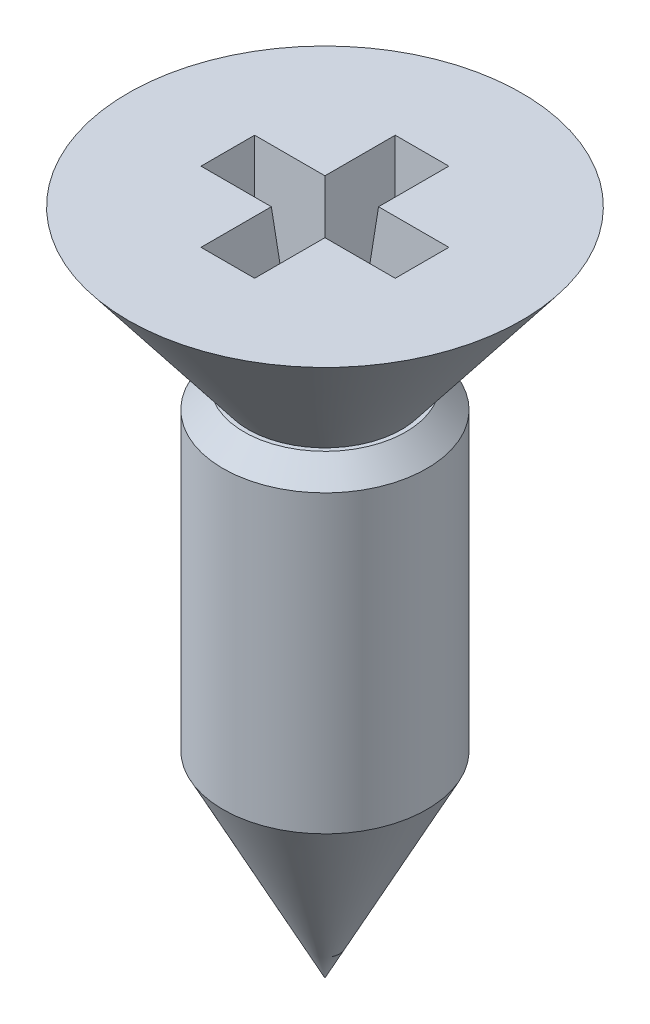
ISO-10303-21;
HEADER;
FILE_DESCRIPTION(('STEP AP214'),'2;1');
FILE_NAME('part.step','',(''),(''),'','','');
FILE_SCHEMA(('AUTOMOTIVE_DESIGN { 1 0 10303 214 1 1 1 1 }'));
ENDSEC;
DATA;
#1=APPLICATION_CONTEXT('core data for automotive mechanical design processes');
#2=APPLICATION_PROTOCOL_DEFINITION('international standard','automotive_design',2000,#1);
#3=PRODUCT_CONTEXT('',#1,'mechanical');
#4=PRODUCT('Part','Part','',(#3));
#5=PRODUCT_RELATED_PRODUCT_CATEGORY('part','',(#4));
#6=PRODUCT_DEFINITION_FORMATION('','',#4);
#7=PRODUCT_DEFINITION_CONTEXT('part definition',#1,'design');
#8=PRODUCT_DEFINITION('design','',#6,#7);
#9=PRODUCT_DEFINITION_SHAPE('','',#8);
#10=(LENGTH_UNIT() NAMED_UNIT(*) SI_UNIT(.MILLI.,.METRE.));
#11=(NAMED_UNIT(*) PLANE_ANGLE_UNIT() SI_UNIT($,.RADIAN.));
#12=(NAMED_UNIT(*) SI_UNIT($,.STERADIAN.) SOLID_ANGLE_UNIT());
#13=UNCERTAINTY_MEASURE_WITH_UNIT(LENGTH_MEASURE(1.E-05),#10,'distance_accuracy_value','');
#14=(GEOMETRIC_REPRESENTATION_CONTEXT(3) GLOBAL_UNCERTAINTY_ASSIGNED_CONTEXT((#13)) GLOBAL_UNIT_ASSIGNED_CONTEXT((#10,
#11,#12)) REPRESENTATION_CONTEXT('',''));
#15=CARTESIAN_POINT('',(0.,0.,0.));
#16=DIRECTION('',(0.,0.,1.));
#17=DIRECTION('',(1.,0.,0.));
#18=AXIS2_PLACEMENT_3D('',#15,#16,#17);
#19=CARTESIAN_POINT('',(0.,-12.9482396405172,0.));
#20=DIRECTION('',(0.,1.,0.));
#21=DIRECTION('',(0.,0.,1.));
#22=AXIS2_PLACEMENT_3D('',#19,#20,#21);
#23=CONICAL_SURFACE('',#22,0.,0.477831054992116);
#24=CARTESIAN_POINT('',(0.,-10.1482396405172,0.));
#25=DIRECTION('',(0.,1.,0.));
#26=DIRECTION('',(0.,0.,1.));
#27=AXIS2_PLACEMENT_3D('',#24,#25,#26);
#28=CIRCLE('',#27,1.45);
#29=CARTESIAN_POINT('',(0.,-10.1482396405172,1.45));
#30=VERTEX_POINT('',#29);
#31=EDGE_CURVE('E192',#30,#30,#28,.T.);
#32=ORIENTED_EDGE('',*,*,#31,.F.);
#33=EDGE_LOOP('',(#32));
#34=FACE_BOUND('',#33,.T.);
#35=CARTESIAN_POINT('',(0.,-12.9482396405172,0.));
#36=VERTEX_POINT('',#35);
#37=VERTEX_LOOP('',#36);
#38=FACE_BOUND('',#37,.T.);
#39=ADVANCED_FACE('F26',(#34,#38),#23,.T.);
#40=CARTESIAN_POINT('',(0.,0.,0.));
#41=DIRECTION('',(0.,1.,0.));
#42=DIRECTION('',(0.,0.,1.));
#43=AXIS2_PLACEMENT_3D('',#40,#41,#42);
#44=CYLINDRICAL_SURFACE('',#43,1.45);
#45=CARTESIAN_POINT('',(0.,-5.94823964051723,0.));
#46=DIRECTION('',(0.,-1.,0.));
#47=DIRECTION('',(0.,0.,-1.));
#48=AXIS2_PLACEMENT_3D('',#45,#46,#47);
#49=CIRCLE('',#48,1.45);
#50=CARTESIAN_POINT('',(0.,-5.94823964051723,-1.45));
#51=VERTEX_POINT('',#50);
#52=EDGE_CURVE('E11',#51,#51,#49,.T.);
#53=ORIENTED_EDGE('',*,*,#52,.T.);
#54=EDGE_LOOP('',(#53));
#55=FACE_BOUND('',#54,.T.);
#56=ORIENTED_EDGE('',*,*,#31,.T.);
#57=EDGE_LOOP('',(#56));
#58=FACE_BOUND('',#57,.T.);
#59=ADVANCED_FACE('F276',(#55,#58),#44,.T.);
#60=CARTESIAN_POINT('',(1.09,-5.64823964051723,0.));
#61=DIRECTION('',(0.,-1.,0.));
#62=DIRECTION('',(0.,0.,-1.));
#63=AXIS2_PLACEMENT_3D('',#60,#61,#62);
#64=PLANE('',#63);
#65=CARTESIAN_POINT('',(0.,-5.64823964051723,0.));
#66=DIRECTION('',(0.,-1.,0.));
#67=DIRECTION('',(0.,0.,-1.));
#68=AXIS2_PLACEMENT_3D('',#65,#66,#67);
#69=CIRCLE('',#68,1.15000000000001);
#70=CARTESIAN_POINT('',(0.,-5.64823964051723,-1.15));
#71=VERTEX_POINT('',#70);
#72=EDGE_CURVE('E36',#71,#71,#69,.F.);
#73=ORIENTED_EDGE('',*,*,#72,.T.);
#74=EDGE_LOOP('',(#73));
#75=FACE_BOUND('',#74,.T.);
#76=CARTESIAN_POINT('',(0.,-5.64823964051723,0.));
#77=DIRECTION('',(0.,1.,0.));
#78=DIRECTION('',(0.,0.,1.));
#79=AXIS2_PLACEMENT_3D('',#76,#77,#78);
#80=CIRCLE('',#79,1.09);
#81=CARTESIAN_POINT('',(0.,-5.64823964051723,1.09));
#82=VERTEX_POINT('',#81);
#83=EDGE_CURVE('E195',#82,#82,#80,.T.);
#84=ORIENTED_EDGE('',*,*,#83,.F.);
#85=EDGE_LOOP('',(#84));
#86=FACE_BOUND('',#85,.T.);
#87=ADVANCED_FACE('F283',(#75,#86),#64,.F.);
#88=CARTESIAN_POINT('',(0.,-5.64823964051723,0.));
#89=DIRECTION('',(0.,1.,0.));
#90=DIRECTION('',(0.,0.,1.));
#91=AXIS2_PLACEMENT_3D('',#88,#89,#90);
#92=CONICAL_SURFACE('',#91,1.09,0.66072840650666);
#93=CARTESIAN_POINT('',(0.,-3.44823964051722,0.));
#94=DIRECTION('',(0.,1.,0.));
#95=DIRECTION('',(0.,0.,1.));
#96=AXIS2_PLACEMENT_3D('',#93,#94,#95);
#97=CIRCLE('',#96,2.8);
#98=CARTESIAN_POINT('',(0.,-3.44823964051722,2.8));
#99=VERTEX_POINT('',#98);
#100=EDGE_CURVE('E182',#99,#99,#97,.T.);
#101=ORIENTED_EDGE('',*,*,#100,.F.);
#102=EDGE_LOOP('',(#101));
#103=FACE_BOUND('',#102,.T.);
#104=ORIENTED_EDGE('',*,*,#83,.T.);
#105=EDGE_LOOP('',(#104));
#106=FACE_BOUND('',#105,.T.);
#107=ADVANCED_FACE('F347',(#103,#106),#92,.T.);
#108=CARTESIAN_POINT('',(0.,-3.44823964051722,0.));
#109=DIRECTION('',(0.,-1.,0.));
#110=DIRECTION('',(0.,0.,-1.));
#111=AXIS2_PLACEMENT_3D('',#108,#109,#110);
#112=PLANE('',#111);
#113=DIRECTION('',(1.,0.,0.));
#114=VECTOR('',#113,1.);
#115=CARTESIAN_POINT('',(-1.25,-3.44823964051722,-0.381232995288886));
#116=LINE('',#115,#114);
#117=CARTESIAN_POINT('',(-0.381232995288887,-3.44823964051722,-0.381232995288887));
#118=VERTEX_POINT('',#117);
#119=CARTESIAN_POINT('',(-1.38123299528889,-3.44823964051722,-0.381232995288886));
#120=VERTEX_POINT('',#119);
#121=EDGE_CURVE('E121',#118,#120,#116,.F.);
#122=ORIENTED_EDGE('',*,*,#121,.F.);
#123=DIRECTION('',(0.,0.,-1.));
#124=VECTOR('',#123,1.);
#125=CARTESIAN_POINT('',(-0.381232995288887,-3.44823964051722,-0.250000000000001));
#126=LINE('',#125,#124);
#127=CARTESIAN_POINT('',(-0.381232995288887,-3.44823964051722,-1.38123299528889));
#128=VERTEX_POINT('',#127);
#129=EDGE_CURVE('E45',#128,#118,#126,.F.);
#130=ORIENTED_EDGE('',*,*,#129,.F.);
#131=DIRECTION('',(1.,0.,0.));
#132=VECTOR('',#131,1.);
#133=CARTESIAN_POINT('',(-0.250000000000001,-3.44823964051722,-1.38123299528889));
#134=LINE('',#133,#132);
#135=CARTESIAN_POINT('',(0.381232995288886,-3.44823964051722,-1.38123299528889));
#136=VERTEX_POINT('',#135);
#137=EDGE_CURVE('E134',#136,#128,#134,.F.);
#138=ORIENTED_EDGE('',*,*,#137,.F.);
#139=DIRECTION('',(0.,0.,1.));
#140=VECTOR('',#139,1.);
#141=CARTESIAN_POINT('',(0.381232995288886,-3.44823964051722,-1.25));
#142=LINE('',#141,#140);
#143=CARTESIAN_POINT('',(0.381232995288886,-3.44823964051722,-0.381232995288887));
#144=VERTEX_POINT('',#143);
#145=EDGE_CURVE('E138',#144,#136,#142,.F.);
#146=ORIENTED_EDGE('',*,*,#145,.F.);
#147=DIRECTION('',(1.,0.,0.));
#148=VECTOR('',#147,1.);
#149=CARTESIAN_POINT('',(0.249999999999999,-3.44823964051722,-0.381232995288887));
#150=LINE('',#149,#148);
#151=CARTESIAN_POINT('',(1.38123299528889,-3.44823964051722,-0.381232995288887));
#152=VERTEX_POINT('',#151);
#153=EDGE_CURVE('E141',#152,#144,#150,.F.);
#154=ORIENTED_EDGE('',*,*,#153,.F.);
#155=DIRECTION('',(0.,0.,1.));
#156=VECTOR('',#155,1.);
#157=CARTESIAN_POINT('',(1.38123299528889,-3.44823964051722,-0.250000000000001));
#158=LINE('',#157,#156);
#159=CARTESIAN_POINT('',(1.38123299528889,-3.44823964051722,0.381232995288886));
#160=VERTEX_POINT('',#159);
#161=EDGE_CURVE('E143',#160,#152,#158,.F.);
#162=ORIENTED_EDGE('',*,*,#161,.F.);
#163=DIRECTION('',(-1.,0.,0.));
#164=VECTOR('',#163,1.);
#165=CARTESIAN_POINT('',(1.25,-3.44823964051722,0.381232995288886));
#166=LINE('',#165,#164);
#167=CARTESIAN_POINT('',(0.381232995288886,-3.44823964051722,0.381232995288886));
#168=VERTEX_POINT('',#167);
#169=EDGE_CURVE('E30',#168,#160,#166,.F.);
#170=ORIENTED_EDGE('',*,*,#169,.F.);
#171=DIRECTION('',(0.,0.,1.));
#172=VECTOR('',#171,1.);
#173=CARTESIAN_POINT('',(0.381232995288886,-3.44823964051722,0.25));
#174=LINE('',#173,#172);
#175=CARTESIAN_POINT('',(0.381232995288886,-3.44823964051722,1.38123299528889));
#176=VERTEX_POINT('',#175);
#177=EDGE_CURVE('E147',#176,#168,#174,.F.);
#178=ORIENTED_EDGE('',*,*,#177,.F.);
#179=DIRECTION('',(-1.,0.,0.));
#180=VECTOR('',#179,1.);
#181=CARTESIAN_POINT('',(0.25,-3.44823964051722,1.38123299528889));
#182=LINE('',#181,#180);
#183=CARTESIAN_POINT('',(-0.381232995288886,-3.44823964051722,1.38123299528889));
#184=VERTEX_POINT('',#183);
#185=EDGE_CURVE('E149',#184,#176,#182,.F.);
#186=ORIENTED_EDGE('',*,*,#185,.F.);
#187=DIRECTION('',(0.,0.,-1.));
#188=VECTOR('',#187,1.);
#189=CARTESIAN_POINT('',(-0.381232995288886,-3.44823964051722,1.25));
#190=LINE('',#189,#188);
#191=CARTESIAN_POINT('',(-0.381232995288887,-3.44823964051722,0.381232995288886));
#192=VERTEX_POINT('',#191);
#193=EDGE_CURVE('E129',#192,#184,#190,.F.);
#194=ORIENTED_EDGE('',*,*,#193,.F.);
#195=DIRECTION('',(-1.,0.,0.));
#196=VECTOR('',#195,1.);
#197=CARTESIAN_POINT('',(-0.25,-3.44823964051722,0.381232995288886));
#198=LINE('',#197,#196);
#199=CARTESIAN_POINT('',(-1.38123299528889,-3.44823964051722,0.381232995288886));
#200=VERTEX_POINT('',#199);
#201=EDGE_CURVE('E127',#200,#192,#198,.F.);
#202=ORIENTED_EDGE('',*,*,#201,.F.);
#203=DIRECTION('',(0.,0.,-1.));
#204=VECTOR('',#203,1.);
#205=CARTESIAN_POINT('',(-1.38123299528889,-3.44823964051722,0.25));
#206=LINE('',#205,#204);
#207=EDGE_CURVE('E110',#120,#200,#206,.F.);
#208=ORIENTED_EDGE('',*,*,#207,.F.);
#209=EDGE_LOOP('',(#122,#130,#138,#146,#154,#162,#170,#178,#186,#194,#202,#208));
#210=FACE_BOUND('',#209,.T.);
#211=ORIENTED_EDGE('',*,*,#100,.T.);
#212=EDGE_LOOP('',(#211));
#213=FACE_BOUND('',#212,.T.);
#214=ADVANCED_FACE('F124',(#210,#213),#112,.F.);
#215=CARTESIAN_POINT('',(0.,-5.64823964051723,0.));
#216=DIRECTION('',(0.,-1.,0.));
#217=DIRECTION('',(0.,0.,-1.));
#218=AXIS2_PLACEMENT_3D('',#215,#216,#217);
#219=CONICAL_SURFACE('',#218,1.15000000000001,0.785398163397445);
#220=CARTESIAN_POINT('',(0.,-5.94823964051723,-1.45));
#221=CARTESIAN_POINT('',(0.,-5.94511464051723,-1.446875));
#222=CARTESIAN_POINT('',(0.,-5.94198964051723,-1.44375));
#223=CARTESIAN_POINT('',(0.,-5.93573964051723,-1.4375));
#224=CARTESIAN_POINT('',(0.,-5.93261464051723,-1.434375));
#225=CARTESIAN_POINT('',(0.,-5.92636464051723,-1.428125));
#226=CARTESIAN_POINT('',(0.,-5.92323964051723,-1.425));
#227=CARTESIAN_POINT('',(0.,-5.91698964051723,-1.41875));
#228=CARTESIAN_POINT('',(0.,-5.91386464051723,-1.415625));
#229=CARTESIAN_POINT('',(0.,-5.90761464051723,-1.409375));
#230=CARTESIAN_POINT('',(0.,-5.90448964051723,-1.40625));
#231=CARTESIAN_POINT('',(0.,-5.89823964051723,-1.4));
#232=CARTESIAN_POINT('',(0.,-5.89511464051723,-1.396875));
#233=CARTESIAN_POINT('',(0.,-5.88886464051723,-1.390625));
#234=CARTESIAN_POINT('',(0.,-5.88573964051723,-1.3875));
#235=CARTESIAN_POINT('',(0.,-5.87948964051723,-1.38125));
#236=CARTESIAN_POINT('',(0.,-5.87636464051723,-1.378125));
#237=CARTESIAN_POINT('',(0.,-5.87011464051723,-1.371875));
#238=CARTESIAN_POINT('',(0.,-5.86698964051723,-1.36875));
#239=CARTESIAN_POINT('',(0.,-5.86073964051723,-1.3625));
#240=CARTESIAN_POINT('',(0.,-5.85761464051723,-1.359375));
#241=CARTESIAN_POINT('',(0.,-5.85136464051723,-1.353125));
#242=CARTESIAN_POINT('',(0.,-5.84823964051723,-1.35));
#243=CARTESIAN_POINT('',(0.,-5.84198964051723,-1.34375));
#244=CARTESIAN_POINT('',(0.,-5.83886464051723,-1.340625));
#245=CARTESIAN_POINT('',(0.,-5.83261464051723,-1.334375));
#246=CARTESIAN_POINT('',(0.,-5.82948964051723,-1.33125));
#247=CARTESIAN_POINT('',(0.,-5.82323964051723,-1.325));
#248=CARTESIAN_POINT('',(0.,-5.82011464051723,-1.321875));
#249=CARTESIAN_POINT('',(0.,-5.81386464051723,-1.315625));
#250=CARTESIAN_POINT('',(0.,-5.81073964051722,-1.3125));
#251=CARTESIAN_POINT('',(0.,-5.80448964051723,-1.30625));
#252=CARTESIAN_POINT('',(0.,-5.80136464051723,-1.303125));
#253=CARTESIAN_POINT('',(0.,-5.79511464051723,-1.296875));
#254=CARTESIAN_POINT('',(0.,-5.79198964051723,-1.29375));
#255=CARTESIAN_POINT('',(0.,-5.78573964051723,-1.2875));
#256=CARTESIAN_POINT('',(0.,-5.78261464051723,-1.284375));
#257=CARTESIAN_POINT('',(0.,-5.77636464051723,-1.278125));
#258=CARTESIAN_POINT('',(0.,-5.77323964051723,-1.275));
#259=CARTESIAN_POINT('',(0.,-5.76698964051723,-1.26875));
#260=CARTESIAN_POINT('',(0.,-5.76386464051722,-1.265625));
#261=CARTESIAN_POINT('',(0.,-5.75761464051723,-1.259375));
#262=CARTESIAN_POINT('',(0.,-5.75448964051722,-1.25625));
#263=CARTESIAN_POINT('',(0.,-5.74823964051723,-1.25));
#264=CARTESIAN_POINT('',(0.,-5.74511464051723,-1.246875));
#265=CARTESIAN_POINT('',(0.,-5.73886464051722,-1.240625));
#266=CARTESIAN_POINT('',(0.,-5.73573964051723,-1.2375));
#267=CARTESIAN_POINT('',(0.,-5.72948964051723,-1.23125));
#268=CARTESIAN_POINT('',(0.,-5.72636464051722,-1.228125));
#269=CARTESIAN_POINT('',(0.,-5.72011464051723,-1.221875));
#270=CARTESIAN_POINT('',(0.,-5.71698964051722,-1.21875));
#271=CARTESIAN_POINT('',(0.,-5.71073964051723,-1.2125));
#272=CARTESIAN_POINT('',(0.,-5.70761464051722,-1.209375));
#273=CARTESIAN_POINT('',(0.,-5.70136464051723,-1.203125));
#274=CARTESIAN_POINT('',(0.,-5.69823964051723,-1.2));
#275=CARTESIAN_POINT('',(0.,-5.69198964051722,-1.19375));
#276=CARTESIAN_POINT('',(0.,-5.68886464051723,-1.190625));
#277=CARTESIAN_POINT('',(0.,-5.68261464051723,-1.184375));
#278=CARTESIAN_POINT('',(0.,-5.67948964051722,-1.18125));
#279=CARTESIAN_POINT('',(0.,-5.67323964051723,-1.175));
#280=CARTESIAN_POINT('',(0.,-5.67011464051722,-1.171875));
#281=CARTESIAN_POINT('',(0.,-5.66386464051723,-1.165625));
#282=CARTESIAN_POINT('',(0.,-5.66073964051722,-1.1625));
#283=CARTESIAN_POINT('',(0.,-5.65448964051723,-1.15625));
#284=CARTESIAN_POINT('',(0.,-5.65136464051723,-1.153125));
#285=CARTESIAN_POINT('',(0.,-5.64823964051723,-1.15));
#286=B_SPLINE_CURVE_WITH_KNOTS('',3,(#220,#221,#222,#223,#224,#225,#226,#227,#228,#229,#230,
#231,#232,#233,#234,#235,#236,#237,#238,#239,#240,#241,#242,#243,#244,#245,#246,#247,#248,#249,
#250,#251,#252,#253,#254,#255,#256,#257,#258,#259,#260,#261,#262,#263,#264,#265,#266,#267,#268,
#269,#270,#271,#272,#273,#274,#275,#276,#277,#278,#279,#280,#281,#282,#283,#284,#285),
.UNSPECIFIED.,.F.,.F.,(4,2,2,2,2,2,2,2,2,2,2,2,2,2,2,2,2,2,2,2,2,2,2,2,2,2,2,2,2,2,2,2,4),(0.,
0.0132582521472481,0.0265165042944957,0.0397747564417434,0.0530330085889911,0.0662912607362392,
0.0795495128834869,0.0928077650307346,0.106066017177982,0.11932426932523,0.132582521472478,
0.145840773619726,0.159099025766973,0.172357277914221,0.185615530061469,0.198873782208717,
0.212132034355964,0.225390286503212,0.23864853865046,0.251906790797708,0.265165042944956,
0.278423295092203,0.291681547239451,0.304939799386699,0.318198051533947,0.331456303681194,
0.344714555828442,0.357972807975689,0.371231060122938,0.384489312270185,0.397747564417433,
0.41100581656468,0.424264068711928),.UNSPECIFIED.);
#287=EDGE_CURVE('BSEAM272',#51,#71,#286,.T.);
#288=ORIENTED_EDGE('',*,*,#52,.F.);
#289=ORIENTED_EDGE('',*,*,#72,.F.);
#290=ORIENTED_EDGE('',*,*,#287,.T.);
#291=ORIENTED_EDGE('',*,*,#287,.F.);
#292=EDGE_LOOP('',(#288,#290,#289,#291));
#293=FACE_BOUND('',#292,.T.);
#294=ADVANCED_FACE('F272',(#293),#219,.T.);
#295=CARTESIAN_POINT('',(-0.25,-4.94823964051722,-0.250000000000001));
#296=DIRECTION('',(0.996194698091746,0.0871557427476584,0.));
#297=DIRECTION('',(-0.0871557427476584,0.996194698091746,0.));
#298=AXIS2_PLACEMENT_3D('',#295,#296,#297);
#299=PLANE('',#298);
#300=ORIENTED_EDGE('',*,*,#129,.T.);
#301=DIRECTION('',(-0.0868265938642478,0.992432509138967,-0.0868265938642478));
#302=VECTOR('',#301,1.);
#303=CARTESIAN_POINT('',(-0.257538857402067,-4.86207010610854,-0.257538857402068));
#304=LINE('',#303,#302);
#305=CARTESIAN_POINT('',(-0.25,-4.94823964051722,-0.250000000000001));
#306=VERTEX_POINT('',#305);
#307=EDGE_CURVE('E118',#306,#118,#304,.T.);
#308=ORIENTED_EDGE('',*,*,#307,.F.);
#309=DIRECTION('',(0.,0.,1.));
#310=VECTOR('',#309,1.);
#311=CARTESIAN_POINT('',(-0.25,-4.94823964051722,-0.250000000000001));
#312=LINE('',#311,#310);
#313=CARTESIAN_POINT('',(-0.250000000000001,-4.94823964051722,-1.25));
#314=VERTEX_POINT('',#313);
#315=EDGE_CURVE('E137',#314,#306,#312,.T.);
#316=ORIENTED_EDGE('',*,*,#315,.F.);
#317=DIRECTION('',(-0.0868265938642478,0.992432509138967,-0.0868265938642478));
#318=VECTOR('',#317,1.);
#319=CARTESIAN_POINT('',(-0.250000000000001,-4.94823964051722,-1.25));
#320=LINE('',#319,#318);
#321=EDGE_CURVE('E180',#314,#128,#320,.T.);
#322=ORIENTED_EDGE('',*,*,#321,.T.);
#323=EDGE_LOOP('',(#300,#308,#316,#322));
#324=FACE_BOUND('',#323,.T.);
#325=ADVANCED_FACE('F232',(#324),#299,.T.);
#326=CARTESIAN_POINT('',(-0.250000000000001,-4.94823964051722,-1.25));
#327=DIRECTION('',(0.,0.0871557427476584,0.996194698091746));
#328=DIRECTION('',(0.,-0.996194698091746,0.0871557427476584));
#329=AXIS2_PLACEMENT_3D('',#326,#327,#328);
#330=PLANE('',#329);
#331=ORIENTED_EDGE('',*,*,#137,.T.);
#332=ORIENTED_EDGE('',*,*,#321,.F.);
#333=DIRECTION('',(-1.,0.,0.));
#334=VECTOR('',#333,1.);
#335=CARTESIAN_POINT('',(-0.250000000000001,-4.94823964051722,-1.25));
#336=LINE('',#335,#334);
#337=CARTESIAN_POINT('',(0.249999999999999,-4.94823964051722,-1.25));
#338=VERTEX_POINT('',#337);
#339=EDGE_CURVE('E179',#338,#314,#336,.T.);
#340=ORIENTED_EDGE('',*,*,#339,.F.);
#341=DIRECTION('',(0.0868265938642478,0.992432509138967,-0.0868265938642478));
#342=VECTOR('',#341,1.);
#343=CARTESIAN_POINT('',(0.249999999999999,-4.94823964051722,-1.25));
#344=LINE('',#343,#342);
#345=EDGE_CURVE('E183',#338,#136,#344,.T.);
#346=ORIENTED_EDGE('',*,*,#345,.T.);
#347=EDGE_LOOP('',(#331,#332,#340,#346));
#348=FACE_BOUND('',#347,.T.);
#349=ADVANCED_FACE('F264',(#348),#330,.T.);
#350=CARTESIAN_POINT('',(0.249999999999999,-4.94823964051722,-1.25));
#351=DIRECTION('',(-0.996194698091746,0.0871557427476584,0.));
#352=DIRECTION('',(-0.0871557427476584,-0.996194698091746,0.));
#353=AXIS2_PLACEMENT_3D('',#350,#351,#352);
#354=PLANE('',#353);
#355=ORIENTED_EDGE('',*,*,#145,.T.);
#356=ORIENTED_EDGE('',*,*,#345,.F.);
#357=DIRECTION('',(0.,0.,-1.));
#358=VECTOR('',#357,1.);
#359=CARTESIAN_POINT('',(0.249999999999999,-4.94823964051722,-1.25));
#360=LINE('',#359,#358);
#361=CARTESIAN_POINT('',(0.249999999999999,-4.94823964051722,-0.250000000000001));
#362=VERTEX_POINT('',#361);
#363=EDGE_CURVE('E202',#362,#338,#360,.T.);
#364=ORIENTED_EDGE('',*,*,#363,.F.);
#365=DIRECTION('',(0.0868265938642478,0.992432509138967,-0.0868265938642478));
#366=VECTOR('',#365,1.);
#367=CARTESIAN_POINT('',(0.257538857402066,-4.86207010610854,-0.257538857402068));
#368=LINE('',#367,#366);
#369=EDGE_CURVE('E185',#362,#144,#368,.T.);
#370=ORIENTED_EDGE('',*,*,#369,.T.);
#371=EDGE_LOOP('',(#355,#356,#364,#370));
#372=FACE_BOUND('',#371,.T.);
#373=ADVANCED_FACE('F262',(#372),#354,.T.);
#374=CARTESIAN_POINT('',(0.249999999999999,-4.94823964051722,-0.250000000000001));
#375=DIRECTION('',(0.,0.0871557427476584,0.996194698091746));
#376=DIRECTION('',(0.,-0.996194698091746,0.0871557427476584));
#377=AXIS2_PLACEMENT_3D('',#374,#375,#376);
#378=PLANE('',#377);
#379=ORIENTED_EDGE('',*,*,#153,.T.);
#380=ORIENTED_EDGE('',*,*,#369,.F.);
#381=DIRECTION('',(-1.,0.,0.));
#382=VECTOR('',#381,1.);
#383=CARTESIAN_POINT('',(0.249999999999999,-4.94823964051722,-0.250000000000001));
#384=LINE('',#383,#382);
#385=CARTESIAN_POINT('',(1.25,-4.94823964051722,-0.250000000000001));
#386=VERTEX_POINT('',#385);
#387=EDGE_CURVE('E205',#386,#362,#384,.T.);
#388=ORIENTED_EDGE('',*,*,#387,.F.);
#389=DIRECTION('',(0.0868265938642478,0.992432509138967,-0.0868265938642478));
#390=VECTOR('',#389,1.);
#391=CARTESIAN_POINT('',(1.25,-4.94823964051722,-0.250000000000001));
#392=LINE('',#391,#390);
#393=EDGE_CURVE('E186',#386,#152,#392,.T.);
#394=ORIENTED_EDGE('',*,*,#393,.T.);
#395=EDGE_LOOP('',(#379,#380,#388,#394));
#396=FACE_BOUND('',#395,.T.);
#397=ADVANCED_FACE('F259',(#396),#378,.T.);
#398=CARTESIAN_POINT('',(1.25,-4.94823964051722,-0.250000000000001));
#399=DIRECTION('',(-0.996194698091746,0.0871557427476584,0.));
#400=DIRECTION('',(-0.0871557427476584,-0.996194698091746,0.));
#401=AXIS2_PLACEMENT_3D('',#398,#399,#400);
#402=PLANE('',#401);
#403=ORIENTED_EDGE('',*,*,#161,.T.);
#404=ORIENTED_EDGE('',*,*,#393,.F.);
#405=DIRECTION('',(0.,0.,-1.));
#406=VECTOR('',#405,1.);
#407=CARTESIAN_POINT('',(1.25,-4.94823964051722,-0.250000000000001));
#408=LINE('',#407,#406);
#409=CARTESIAN_POINT('',(1.25,-4.94823964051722,0.249999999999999));
#410=VERTEX_POINT('',#409);
#411=EDGE_CURVE('E208',#410,#386,#408,.T.);
#412=ORIENTED_EDGE('',*,*,#411,.F.);
#413=DIRECTION('',(0.0868265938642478,0.992432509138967,0.0868265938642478));
#414=VECTOR('',#413,1.);
#415=CARTESIAN_POINT('',(1.25,-4.94823964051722,0.249999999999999));
#416=LINE('',#415,#414);
#417=EDGE_CURVE('E71',#410,#160,#416,.T.);
#418=ORIENTED_EDGE('',*,*,#417,.T.);
#419=EDGE_LOOP('',(#403,#404,#412,#418));
#420=FACE_BOUND('',#419,.T.);
#421=ADVANCED_FACE('F257',(#420),#402,.T.);
#422=CARTESIAN_POINT('',(1.25,-4.94823964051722,0.249999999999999));
#423=DIRECTION('',(0.,0.0871557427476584,-0.996194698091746));
#424=DIRECTION('',(0.,0.996194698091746,0.0871557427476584));
#425=AXIS2_PLACEMENT_3D('',#422,#423,#424);
#426=PLANE('',#425);
#427=ORIENTED_EDGE('',*,*,#169,.T.);
#428=ORIENTED_EDGE('',*,*,#417,.F.);
#429=DIRECTION('',(1.,0.,0.));
#430=VECTOR('',#429,1.);
#431=CARTESIAN_POINT('',(1.25,-4.94823964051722,0.249999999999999));
#432=LINE('',#431,#430);
#433=CARTESIAN_POINT('',(0.25,-4.94823964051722,0.25));
#434=VERTEX_POINT('',#433);
#435=EDGE_CURVE('E211',#434,#410,#432,.T.);
#436=ORIENTED_EDGE('',*,*,#435,.F.);
#437=DIRECTION('',(0.0868265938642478,0.992432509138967,0.0868265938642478));
#438=VECTOR('',#437,1.);
#439=CARTESIAN_POINT('',(0.257538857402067,-4.86207010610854,0.257538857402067));
#440=LINE('',#439,#438);
#441=EDGE_CURVE('E78',#434,#168,#440,.T.);
#442=ORIENTED_EDGE('',*,*,#441,.T.);
#443=EDGE_LOOP('',(#427,#428,#436,#442));
#444=FACE_BOUND('',#443,.T.);
#445=ADVANCED_FACE('F256',(#444),#426,.T.);
#446=CARTESIAN_POINT('',(0.25,-4.94823964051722,0.25));
#447=DIRECTION('',(-0.996194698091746,0.0871557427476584,0.));
#448=DIRECTION('',(-0.0871557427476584,-0.996194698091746,0.));
#449=AXIS2_PLACEMENT_3D('',#446,#447,#448);
#450=PLANE('',#449);
#451=ORIENTED_EDGE('',*,*,#177,.T.);
#452=ORIENTED_EDGE('',*,*,#441,.F.);
#453=DIRECTION('',(0.,0.,-1.));
#454=VECTOR('',#453,1.);
#455=CARTESIAN_POINT('',(0.25,-4.94823964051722,0.25));
#456=LINE('',#455,#454);
#457=CARTESIAN_POINT('',(0.25,-4.94823964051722,1.25));
#458=VERTEX_POINT('',#457);
#459=EDGE_CURVE('E214',#458,#434,#456,.T.);
#460=ORIENTED_EDGE('',*,*,#459,.F.);
#461=DIRECTION('',(0.0868265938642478,0.992432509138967,0.0868265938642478));
#462=VECTOR('',#461,1.);
#463=CARTESIAN_POINT('',(0.25,-4.94823964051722,1.25));
#464=LINE('',#463,#462);
#465=EDGE_CURVE('E86',#458,#176,#464,.T.);
#466=ORIENTED_EDGE('',*,*,#465,.T.);
#467=EDGE_LOOP('',(#451,#452,#460,#466));
#468=FACE_BOUND('',#467,.T.);
#469=ADVANCED_FACE('F255',(#468),#450,.T.);
#470=CARTESIAN_POINT('',(0.25,-4.94823964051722,1.25));
#471=DIRECTION('',(0.,0.0871557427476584,-0.996194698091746));
#472=DIRECTION('',(0.,0.996194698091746,0.0871557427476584));
#473=AXIS2_PLACEMENT_3D('',#470,#471,#472);
#474=PLANE('',#473);
#475=ORIENTED_EDGE('',*,*,#185,.T.);
#476=ORIENTED_EDGE('',*,*,#465,.F.);
#477=DIRECTION('',(1.,0.,0.));
#478=VECTOR('',#477,1.);
#479=CARTESIAN_POINT('',(0.25,-4.94823964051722,1.25));
#480=LINE('',#479,#478);
#481=CARTESIAN_POINT('',(-0.25,-4.94823964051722,1.25));
#482=VERTEX_POINT('',#481);
#483=EDGE_CURVE('E170',#482,#458,#480,.T.);
#484=ORIENTED_EDGE('',*,*,#483,.F.);
#485=DIRECTION('',(-0.0868265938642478,0.992432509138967,0.0868265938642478));
#486=VECTOR('',#485,1.);
#487=CARTESIAN_POINT('',(-0.25,-4.94823964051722,1.25));
#488=LINE('',#487,#486);
#489=EDGE_CURVE('E162',#482,#184,#488,.T.);
#490=ORIENTED_EDGE('',*,*,#489,.T.);
#491=EDGE_LOOP('',(#475,#476,#484,#490));
#492=FACE_BOUND('',#491,.T.);
#493=ADVANCED_FACE('F167',(#492),#474,.T.);
#494=CARTESIAN_POINT('',(-0.25,-4.94823964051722,1.25));
#495=DIRECTION('',(0.996194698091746,0.0871557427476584,0.));
#496=DIRECTION('',(-0.0871557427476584,0.996194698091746,0.));
#497=AXIS2_PLACEMENT_3D('',#494,#495,#496);
#498=PLANE('',#497);
#499=ORIENTED_EDGE('',*,*,#193,.T.);
#500=ORIENTED_EDGE('',*,*,#489,.F.);
#501=DIRECTION('',(0.,0.,1.));
#502=VECTOR('',#501,1.);
#503=CARTESIAN_POINT('',(-0.25,-4.94823964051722,1.25));
#504=LINE('',#503,#502);
#505=CARTESIAN_POINT('',(-0.25,-4.94823964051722,0.25));
#506=VERTEX_POINT('',#505);
#507=EDGE_CURVE('E218',#506,#482,#504,.T.);
#508=ORIENTED_EDGE('',*,*,#507,.F.);
#509=DIRECTION('',(-0.0868265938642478,0.992432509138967,0.0868265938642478));
#510=VECTOR('',#509,1.);
#511=CARTESIAN_POINT('',(-0.257538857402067,-4.86207010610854,0.257538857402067));
#512=LINE('',#511,#510);
#513=EDGE_CURVE('E165',#506,#192,#512,.T.);
#514=ORIENTED_EDGE('',*,*,#513,.T.);
#515=EDGE_LOOP('',(#499,#500,#508,#514));
#516=FACE_BOUND('',#515,.T.);
#517=ADVANCED_FACE('F159',(#516),#498,.T.);
#518=CARTESIAN_POINT('',(-0.25,-4.94823964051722,0.25));
#519=DIRECTION('',(0.,0.0871557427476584,-0.996194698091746));
#520=DIRECTION('',(0.,0.996194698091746,0.0871557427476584));
#521=AXIS2_PLACEMENT_3D('',#518,#519,#520);
#522=PLANE('',#521);
#523=ORIENTED_EDGE('',*,*,#201,.T.);
#524=ORIENTED_EDGE('',*,*,#513,.F.);
#525=DIRECTION('',(1.,0.,0.));
#526=VECTOR('',#525,1.);
#527=CARTESIAN_POINT('',(-0.25,-4.94823964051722,0.25));
#528=LINE('',#527,#526);
#529=CARTESIAN_POINT('',(-1.25,-4.94823964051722,0.25));
#530=VERTEX_POINT('',#529);
#531=EDGE_CURVE('E220',#530,#506,#528,.T.);
#532=ORIENTED_EDGE('',*,*,#531,.F.);
#533=DIRECTION('',(-0.0868265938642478,0.992432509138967,0.0868265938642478));
#534=VECTOR('',#533,1.);
#535=CARTESIAN_POINT('',(-1.25,-4.94823964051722,0.25));
#536=LINE('',#535,#534);
#537=EDGE_CURVE('E100',#530,#200,#536,.T.);
#538=ORIENTED_EDGE('',*,*,#537,.T.);
#539=EDGE_LOOP('',(#523,#524,#532,#538));
#540=FACE_BOUND('',#539,.T.);
#541=ADVANCED_FACE('F254',(#540),#522,.T.);
#542=CARTESIAN_POINT('',(-1.25,-4.94823964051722,0.25));
#543=DIRECTION('',(0.996194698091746,0.0871557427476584,0.));
#544=DIRECTION('',(-0.0871557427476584,0.996194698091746,0.));
#545=AXIS2_PLACEMENT_3D('',#542,#543,#544);
#546=PLANE('',#545);
#547=ORIENTED_EDGE('',*,*,#207,.T.);
#548=ORIENTED_EDGE('',*,*,#537,.F.);
#549=DIRECTION('',(0.,0.,1.));
#550=VECTOR('',#549,1.);
#551=CARTESIAN_POINT('',(-1.25,-4.94823964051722,0.25));
#552=LINE('',#551,#550);
#553=CARTESIAN_POINT('',(-1.25,-4.94823964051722,-0.25));
#554=VERTEX_POINT('',#553);
#555=EDGE_CURVE('E114',#554,#530,#552,.T.);
#556=ORIENTED_EDGE('',*,*,#555,.F.);
#557=DIRECTION('',(-0.0868265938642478,0.992432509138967,-0.0868265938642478));
#558=VECTOR('',#557,1.);
#559=CARTESIAN_POINT('',(-1.25,-4.94823964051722,-0.25));
#560=LINE('',#559,#558);
#561=EDGE_CURVE('E106',#554,#120,#560,.T.);
#562=ORIENTED_EDGE('',*,*,#561,.T.);
#563=EDGE_LOOP('',(#547,#548,#556,#562));
#564=FACE_BOUND('',#563,.T.);
#565=ADVANCED_FACE('F108',(#564),#546,.T.);
#566=CARTESIAN_POINT('',(-1.25,-4.94823964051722,-0.25));
#567=DIRECTION('',(0.,0.0871557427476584,0.996194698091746));
#568=DIRECTION('',(0.,-0.996194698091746,0.0871557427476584));
#569=AXIS2_PLACEMENT_3D('',#566,#567,#568);
#570=PLANE('',#569);
#571=ORIENTED_EDGE('',*,*,#121,.T.);
#572=ORIENTED_EDGE('',*,*,#561,.F.);
#573=DIRECTION('',(-1.,0.,0.));
#574=VECTOR('',#573,1.);
#575=CARTESIAN_POINT('',(-1.25,-4.94823964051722,-0.25));
#576=LINE('',#575,#574);
#577=EDGE_CURVE('E224',#306,#554,#576,.T.);
#578=ORIENTED_EDGE('',*,*,#577,.F.);
#579=ORIENTED_EDGE('',*,*,#307,.T.);
#580=EDGE_LOOP('',(#571,#572,#578,#579));
#581=FACE_BOUND('',#580,.T.);
#582=ADVANCED_FACE('F28',(#581),#570,.T.);
#583=CARTESIAN_POINT('',(-0.25,-4.94823964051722,0.25));
#584=DIRECTION('',(0.,1.,0.));
#585=DIRECTION('',(0.,0.,1.));
#586=AXIS2_PLACEMENT_3D('',#583,#584,#585);
#587=PLANE('',#586);
#588=ORIENTED_EDGE('',*,*,#315,.T.);
#589=ORIENTED_EDGE('',*,*,#577,.T.);
#590=ORIENTED_EDGE('',*,*,#555,.T.);
#591=ORIENTED_EDGE('',*,*,#531,.T.);
#592=ORIENTED_EDGE('',*,*,#507,.T.);
#593=ORIENTED_EDGE('',*,*,#483,.T.);
#594=ORIENTED_EDGE('',*,*,#459,.T.);
#595=ORIENTED_EDGE('',*,*,#435,.T.);
#596=ORIENTED_EDGE('',*,*,#411,.T.);
#597=ORIENTED_EDGE('',*,*,#387,.T.);
#598=ORIENTED_EDGE('',*,*,#363,.T.);
#599=ORIENTED_EDGE('',*,*,#339,.T.);
#600=EDGE_LOOP('',(#588,#589,#590,#591,#592,#593,#594,#595,#596,#597,#598,#599));
#601=FACE_BOUND('',#600,.T.);
#602=ADVANCED_FACE('F229',(#601),#587,.T.);
#603=CLOSED_SHELL('',(#39,#59,#87,#107,#214,#294,#325,#349,#373,#397,#421,#445,#469,#493,#517,
#541,#565,#582,#602));
#604=MANIFOLD_SOLID_BREP('B2',#603);
#605=ADVANCED_BREP_SHAPE_REPRESENTATION('',(#18,#604),#14);
#606=SHAPE_DEFINITION_REPRESENTATION(#9,#605);
ENDSEC;
END-ISO-10303-21;
